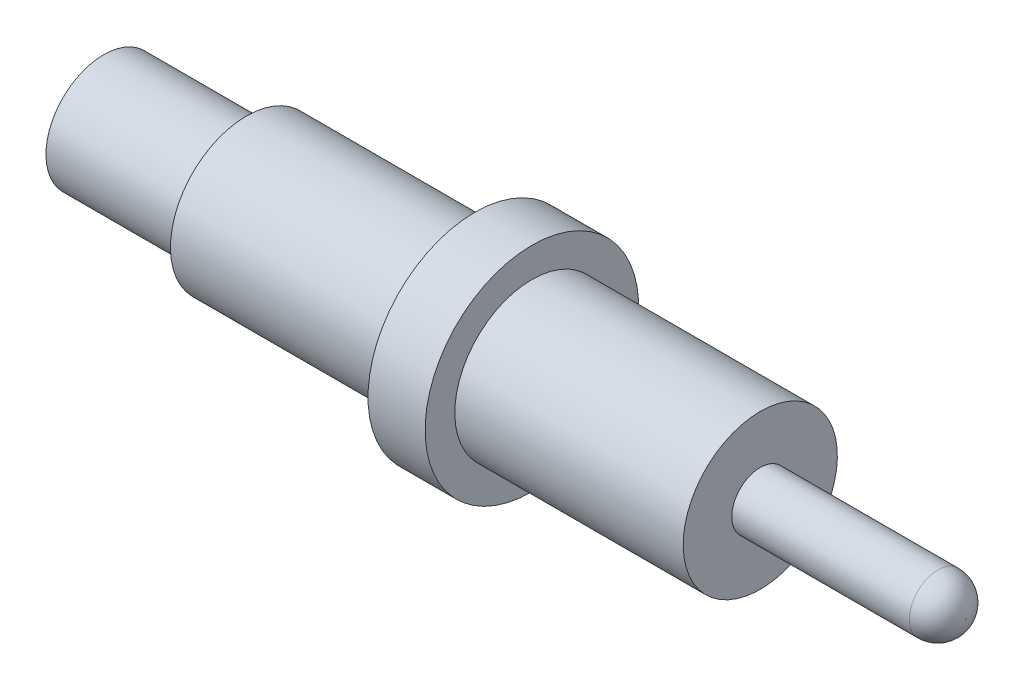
from build123d import *


with BuildPart() as part:
    # Sketch1 → Revolve1 (revolve)
    with BuildSketch(Plane.XY):
        with BuildLine():
            Line((-9.652, 1.7145), (-4.572, 1.7145))
            Line((-4.572, 1.7145), (-4.572, 0.635))
            Line((-4.572, 0.635), (-0.6223, 0.635))
            ThreePointArc((-0.6223, 0.635), (-0.18226745, 0.45273255), (0, 0.0127))
            Line((0, 0.0127), (0, 0))
            Line((0, 0), (-19.177, 0))
            Line((-19.177, 0), (-19.177, 1.2827))
            Line((-19.177, 1.2827), (-16.002, 1.2827))
            Line((-16.002, 1.2827), (-16.002, 1.6891))
            Line((-16.002, 1.6891), (-10.922, 1.6891))
            Line((-10.922, 1.6891), (-10.922, 2.3749))
            Line((-10.922, 2.3749), (-9.652, 2.3749))
            Line((-9.652, 2.3749), (-9.652, 1.7145))
        make_face()
    revolve(axis=Axis((0, 0, 0), (-1, 0, 0)))


solid = part.part
